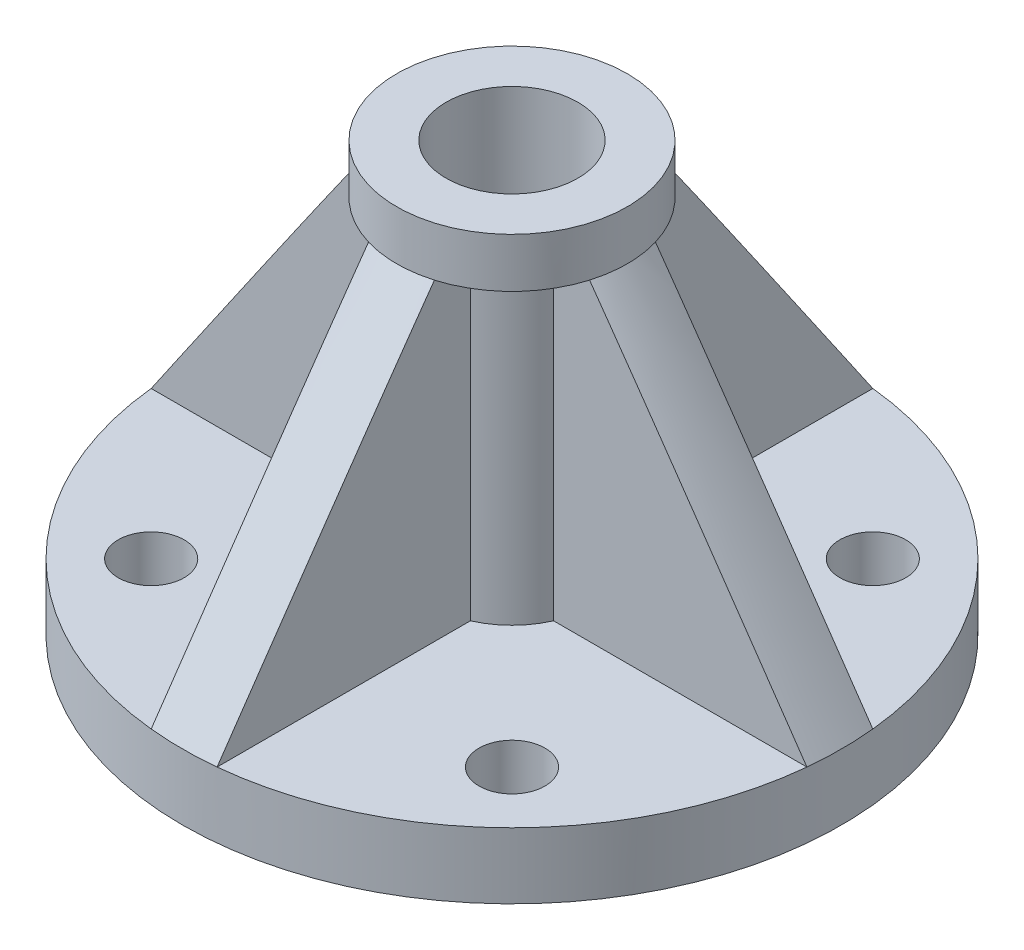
from build123d import *

# Parameters (mm, degrees)
CUT_EXTRUDE1_START         = -47.5
CUT_EXTRUDE1_DEPTH         = 47.5
F_10_0_10_DIAMETER_HOLE1_D = 10
CIRPATTERN1_COUNT          = 4


with BuildPart() as part:
    # Sketch1 → Revolve1 (revolve)
    with BuildSketch(Plane.XY, mode=Mode.PRIVATE) as revolve1_sk:
        Polygon((-10, 0), (-10, 65), (-17.5, 65), (-17.5, 57.5), (-50, 10), (-50, 0), align=None)
    revolve(revolve1_sk.sketch.rotate(Axis((0, 0, 0), (0, 1, 0)), 270), axis=Axis((0, 0, 0), (0, 1, 0)))

    # Sketch2 → Cut-Extrude1 (cut)
    with BuildSketch(Plane(origin=(0, 57.5, 0), x_dir=(-1, 0, 0), z_dir=(0, 1, 0)).offset(CUT_EXTRUDE1_START)):
        with BuildLine():
            Line((-5, 11.312729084), (-5, 49.749371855))
            ThreePointArc((-5, 49.749371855), (-35.355339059, 35.355339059), (-49.749371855, 5))
            Line((-49.749371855, 5), (-11.312729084, 5))
            ThreePointArc((-11.312729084, 5), (-8.745794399, 8.745794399), (-5, 11.312729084))
        make_face()
    cut_extrude1 = extrude(amount=CUT_EXTRUDE1_DEPTH, mode=Mode.SUBTRACT)

    # 10.0 _10_ Diameter Hole1 (through all)
    with Locations(Plane(origin=(0, 10, 0), x_dir=(-1, 0, 0), z_dir=(0, 1, 0))):
        with Locations((-27.374685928, 27.374685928)):
            f_10_0_10_diameter_hole1 = Hole(F_10_0_10_DIAMETER_HOLE1_D / 2)

    # CirPattern1: Cut-Extrude1, 10.0 _10_ Diameter Hole1 ×4 about axis
    cirpattern1_axis = Axis((0, 0, 0), (0, 1, 0))
    add([cut_extrude1.rotate(cirpattern1_axis, i * 360 / CIRPATTERN1_COUNT) for i in range(1, CIRPATTERN1_COUNT)], mode=Mode.SUBTRACT)
    add([f_10_0_10_diameter_hole1.rotate(cirpattern1_axis, i * 360 / CIRPATTERN1_COUNT) for i in range(1, CIRPATTERN1_COUNT)], mode=Mode.SUBTRACT)


solid = part.part
